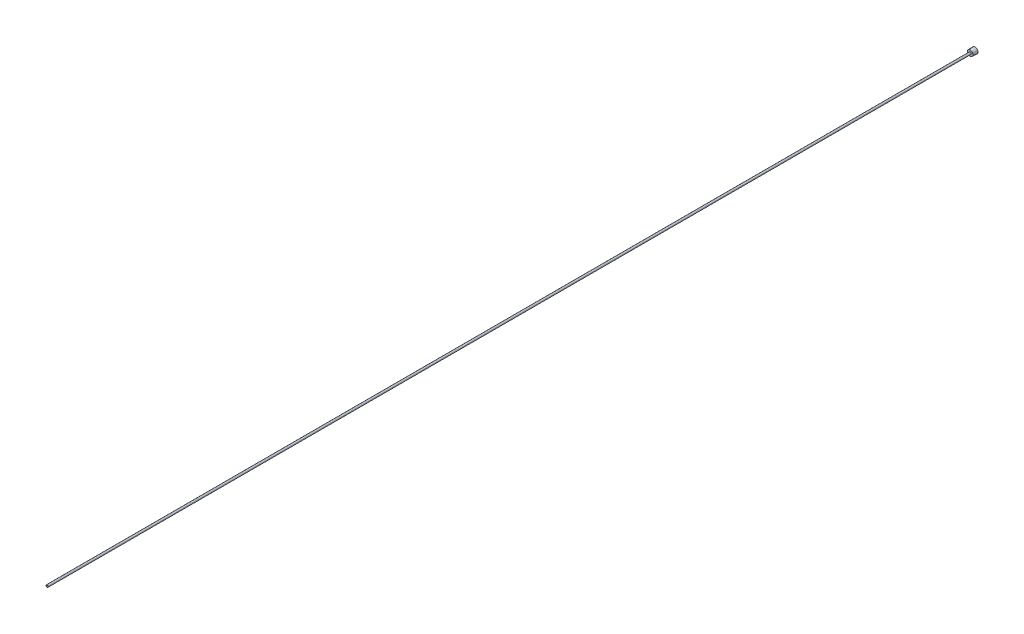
from build123d import *

# Parameters (mm, degrees)
SKETCH2_R          = 1.2065
CUT_EXTRUDE1_DEPTH = 1220.212468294
CUT_EXTRUDE2_DEPTH = 3.96875


with BuildPart() as part:
    # Sketch1 → Revolve1 (revolve)
    with BuildSketch(Plane(origin=(0, 0, 0), x_dir=(0, 0, -1), z_dir=(1, 0, 0)), mode=Mode.PRIVATE) as revolve1_sk:
        Polygon((-1219.2, 0), (0, 0), (0, 3.8989), (-6.35, 3.667387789), (-6.35, 1.3890625), (-1219.2, 1.3890625), align=None)
    revolve(revolve1_sk.sketch.rotate(Axis((0, 0, 0), (0, 0, -1)), 90), axis=Axis((0, 0, 0), (0, 0, -1)))

    # Sketch2 → Cut-Extrude1 (cut, through all)
    with BuildSketch(Plane.XY.offset(1219.2)):
        Circle(SKETCH2_R)
    extrude(amount=-CUT_EXTRUDE1_DEPTH, mode=Mode.SUBTRACT)

    # Sketch3 → Cut-Extrude2 (cut)
    with BuildSketch(Plane(origin=(0, 0, 0), x_dir=(-1, 0, 0), z_dir=(0, 0, -1))):
        Polygon((0, -2.756963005), (2.3876, -1.378481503), (2.3876, 1.378481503), (0, 2.756963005), (-2.3876, 1.378481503), (-2.3876, -1.378481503), align=None)
    extrude(amount=-CUT_EXTRUDE2_DEPTH, mode=Mode.SUBTRACT)


solid = part.part
